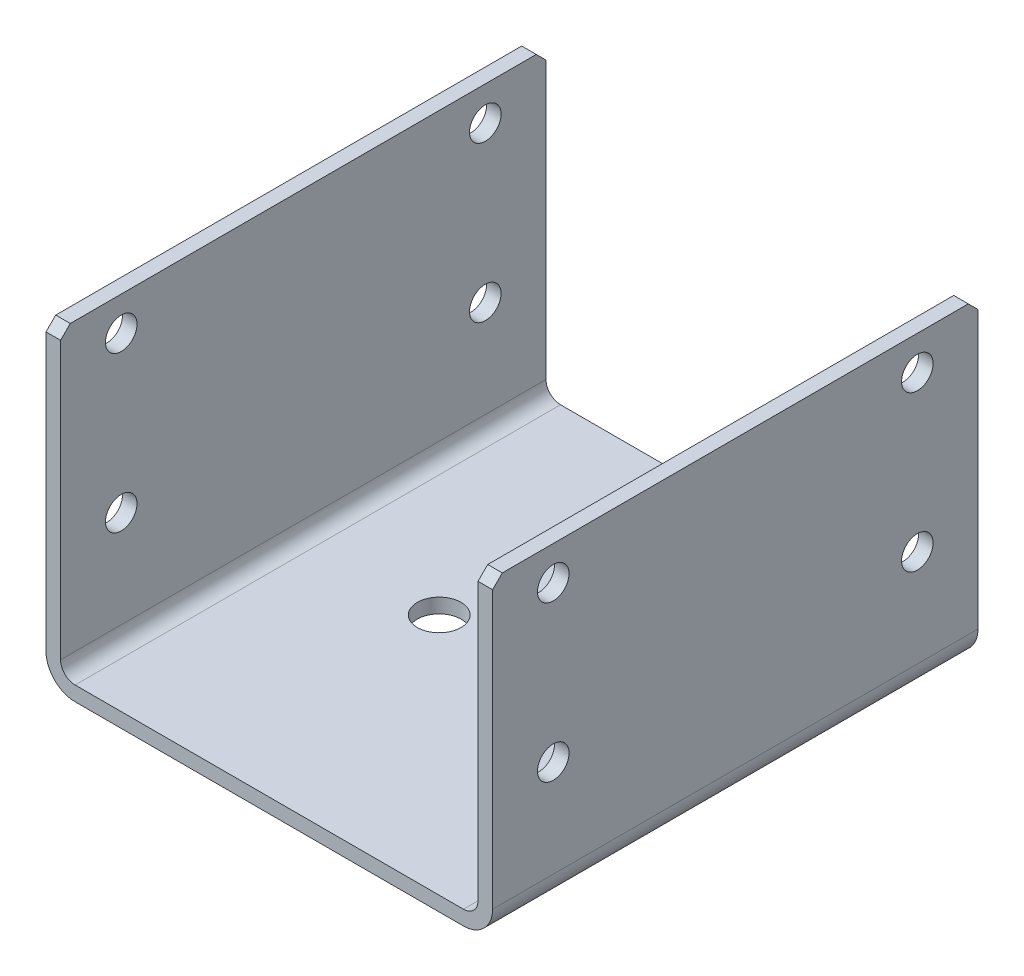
ISO-10303-21;
HEADER;
FILE_DESCRIPTION(('STEP AP214'),'2;1');
FILE_NAME('part.step','',(''),(''),'','','');
FILE_SCHEMA(('AUTOMOTIVE_DESIGN { 1 0 10303 214 1 1 1 1 }'));
ENDSEC;
DATA;
#1=APPLICATION_CONTEXT('core data for automotive mechanical design processes');
#2=APPLICATION_PROTOCOL_DEFINITION('international standard','automotive_design',2000,#1);
#3=PRODUCT_CONTEXT('',#1,'mechanical');
#4=PRODUCT('Part','Part','',(#3));
#5=PRODUCT_RELATED_PRODUCT_CATEGORY('part','',(#4));
#6=PRODUCT_DEFINITION_FORMATION('','',#4);
#7=PRODUCT_DEFINITION_CONTEXT('part definition',#1,'design');
#8=PRODUCT_DEFINITION('design','',#6,#7);
#9=PRODUCT_DEFINITION_SHAPE('','',#8);
#10=(LENGTH_UNIT() NAMED_UNIT(*) SI_UNIT(.MILLI.,.METRE.));
#11=(NAMED_UNIT(*) PLANE_ANGLE_UNIT() SI_UNIT($,.RADIAN.));
#12=(NAMED_UNIT(*) SI_UNIT($,.STERADIAN.) SOLID_ANGLE_UNIT());
#13=UNCERTAINTY_MEASURE_WITH_UNIT(LENGTH_MEASURE(1.E-05),#10,'distance_accuracy_value','');
#14=(GEOMETRIC_REPRESENTATION_CONTEXT(3) GLOBAL_UNCERTAINTY_ASSIGNED_CONTEXT((#13)) GLOBAL_UNIT_ASSIGNED_CONTEXT((#10,
#11,#12)) REPRESENTATION_CONTEXT('',''));
#15=CARTESIAN_POINT('',(0.,0.,0.));
#16=DIRECTION('',(0.,0.,1.));
#17=DIRECTION('',(1.,0.,0.));
#18=AXIS2_PLACEMENT_3D('',#15,#16,#17);
#19=CARTESIAN_POINT('',(-40.,6.,50.));
#20=DIRECTION('',(0.,0.,-1.));
#21=DIRECTION('',(-1.,0.,0.));
#22=AXIS2_PLACEMENT_3D('',#19,#20,#21);
#23=CYLINDRICAL_SURFACE('',#22,6.);
#24=DIRECTION('',(0.,0.,-1.));
#25=VECTOR('',#24,1.);
#26=CARTESIAN_POINT('',(-46.,6.,50.));
#27=LINE('',#26,#25);
#28=CARTESIAN_POINT('',(-46.,6.,50.));
#29=VERTEX_POINT('',#28);
#30=CARTESIAN_POINT('',(-46.,6.,-50.));
#31=VERTEX_POINT('',#30);
#32=EDGE_CURVE('E225',#29,#31,#27,.T.);
#33=ORIENTED_EDGE('',*,*,#32,.T.);
#34=CARTESIAN_POINT('',(-40.,6.,-50.));
#35=DIRECTION('',(0.,0.,1.));
#36=DIRECTION('',(1.,0.,0.));
#37=AXIS2_PLACEMENT_3D('',#34,#35,#36);
#38=CIRCLE('',#37,6.);
#39=CARTESIAN_POINT('',(-40.,0.,-50.));
#40=VERTEX_POINT('',#39);
#41=EDGE_CURVE('E182',#31,#40,#38,.T.);
#42=ORIENTED_EDGE('',*,*,#41,.T.);
#43=DIRECTION('',(0.,0.,-1.));
#44=VECTOR('',#43,1.);
#45=CARTESIAN_POINT('',(-40.,0.,50.));
#46=LINE('',#45,#44);
#47=CARTESIAN_POINT('',(-40.,0.,50.));
#48=VERTEX_POINT('',#47);
#49=EDGE_CURVE('E251',#48,#40,#46,.T.);
#50=ORIENTED_EDGE('',*,*,#49,.F.);
#51=CARTESIAN_POINT('',(-40.,6.,50.));
#52=DIRECTION('',(0.,0.,1.));
#53=DIRECTION('',(1.,0.,0.));
#54=AXIS2_PLACEMENT_3D('',#51,#52,#53);
#55=CIRCLE('',#54,6.);
#56=EDGE_CURVE('E208',#29,#48,#55,.T.);
#57=ORIENTED_EDGE('',*,*,#56,.F.);
#58=EDGE_LOOP('',(#33,#42,#50,#57));
#59=FACE_BOUND('',#58,.T.);
#60=ADVANCED_FACE('F16',(#59),#23,.T.);
#61=CARTESIAN_POINT('',(-40.,0.,50.));
#62=DIRECTION('',(0.,1.,0.));
#63=DIRECTION('',(0.,0.,1.));
#64=AXIS2_PLACEMENT_3D('',#61,#62,#63);
#65=PLANE('',#64);
#66=CARTESIAN_POINT('',(-15.,0.,0.));
#67=DIRECTION('',(0.,1.,0.));
#68=DIRECTION('',(0.,0.,1.));
#69=AXIS2_PLACEMENT_3D('',#66,#67,#68);
#70=CIRCLE('',#69,4.5);
#71=CARTESIAN_POINT('',(-15.,0.,4.5));
#72=VERTEX_POINT('',#71);
#73=EDGE_CURVE('E426',#72,#72,#70,.T.);
#74=ORIENTED_EDGE('',*,*,#73,.T.);
#75=EDGE_LOOP('',(#74));
#76=FACE_BOUND('',#75,.T.);
#77=CARTESIAN_POINT('',(15.,0.,0.));
#78=DIRECTION('',(0.,1.,0.));
#79=DIRECTION('',(0.,0.,1.));
#80=AXIS2_PLACEMENT_3D('',#77,#78,#79);
#81=CIRCLE('',#80,4.5);
#82=CARTESIAN_POINT('',(15.,0.,4.5));
#83=VERTEX_POINT('',#82);
#84=EDGE_CURVE('E431',#83,#83,#81,.T.);
#85=ORIENTED_EDGE('',*,*,#84,.T.);
#86=EDGE_LOOP('',(#85));
#87=FACE_BOUND('',#86,.T.);
#88=ORIENTED_EDGE('',*,*,#49,.T.);
#89=DIRECTION('',(1.,0.,0.));
#90=VECTOR('',#89,1.);
#91=CARTESIAN_POINT('',(-40.,0.,-50.));
#92=LINE('',#91,#90);
#93=CARTESIAN_POINT('',(40.,0.,-50.));
#94=VERTEX_POINT('',#93);
#95=EDGE_CURVE('E185',#40,#94,#92,.T.);
#96=ORIENTED_EDGE('',*,*,#95,.T.);
#97=DIRECTION('',(0.,0.,-1.));
#98=VECTOR('',#97,1.);
#99=CARTESIAN_POINT('',(40.,0.,50.));
#100=LINE('',#99,#98);
#101=CARTESIAN_POINT('',(40.,0.,50.));
#102=VERTEX_POINT('',#101);
#103=EDGE_CURVE('E249',#102,#94,#100,.T.);
#104=ORIENTED_EDGE('',*,*,#103,.F.);
#105=DIRECTION('',(1.,0.,0.));
#106=VECTOR('',#105,1.);
#107=CARTESIAN_POINT('',(-40.,0.,50.));
#108=LINE('',#107,#106);
#109=EDGE_CURVE('E211',#48,#102,#108,.T.);
#110=ORIENTED_EDGE('',*,*,#109,.F.);
#111=EDGE_LOOP('',(#88,#96,#104,#110));
#112=FACE_BOUND('',#111,.T.);
#113=ADVANCED_FACE('F274',(#76,#87,#112),#65,.F.);
#114=CARTESIAN_POINT('',(40.,6.,50.));
#115=DIRECTION('',(0.,0.,-1.));
#116=DIRECTION('',(-1.,0.,0.));
#117=AXIS2_PLACEMENT_3D('',#114,#115,#116);
#118=CYLINDRICAL_SURFACE('',#117,6.);
#119=ORIENTED_EDGE('',*,*,#103,.T.);
#120=CARTESIAN_POINT('',(40.,6.,-50.));
#121=DIRECTION('',(0.,0.,1.));
#122=DIRECTION('',(1.,0.,0.));
#123=AXIS2_PLACEMENT_3D('',#120,#121,#122);
#124=CIRCLE('',#123,6.);
#125=CARTESIAN_POINT('',(46.,6.,-50.));
#126=VERTEX_POINT('',#125);
#127=EDGE_CURVE('E188',#94,#126,#124,.T.);
#128=ORIENTED_EDGE('',*,*,#127,.T.);
#129=DIRECTION('',(0.,0.,-1.));
#130=VECTOR('',#129,1.);
#131=CARTESIAN_POINT('',(46.,6.,50.));
#132=LINE('',#131,#130);
#133=CARTESIAN_POINT('',(46.,6.,50.));
#134=VERTEX_POINT('',#133);
#135=EDGE_CURVE('E247',#134,#126,#132,.T.);
#136=ORIENTED_EDGE('',*,*,#135,.F.);
#137=CARTESIAN_POINT('',(40.,6.,50.));
#138=DIRECTION('',(0.,0.,1.));
#139=DIRECTION('',(1.,0.,0.));
#140=AXIS2_PLACEMENT_3D('',#137,#138,#139);
#141=CIRCLE('',#140,6.);
#142=EDGE_CURVE('E132',#102,#134,#141,.T.);
#143=ORIENTED_EDGE('',*,*,#142,.F.);
#144=EDGE_LOOP('',(#119,#128,#136,#143));
#145=FACE_BOUND('',#144,.T.);
#146=ADVANCED_FACE('F270',(#145),#118,.T.);
#147=CARTESIAN_POINT('',(46.,6.,50.));
#148=DIRECTION('',(-1.,0.,0.));
#149=DIRECTION('',(0.,0.,1.));
#150=AXIS2_PLACEMENT_3D('',#147,#148,#149);
#151=PLANE('',#150);
#152=CARTESIAN_POINT('',(46.,26.,-37.5));
#153=DIRECTION('',(-1.,0.,0.));
#154=DIRECTION('',(0.,0.,1.));
#155=AXIS2_PLACEMENT_3D('',#152,#153,#154);
#156=CIRCLE('',#155,3.25);
#157=CARTESIAN_POINT('',(46.,26.,-34.25));
#158=VERTEX_POINT('',#157);
#159=EDGE_CURVE('E404',#158,#158,#156,.T.);
#160=ORIENTED_EDGE('',*,*,#159,.T.);
#161=EDGE_LOOP('',(#160));
#162=FACE_BOUND('',#161,.T.);
#163=CARTESIAN_POINT('',(46.,26.,37.5));
#164=DIRECTION('',(-1.,0.,0.));
#165=DIRECTION('',(0.,0.,1.));
#166=AXIS2_PLACEMENT_3D('',#163,#164,#165);
#167=CIRCLE('',#166,3.25);
#168=CARTESIAN_POINT('',(46.,26.,40.75));
#169=VERTEX_POINT('',#168);
#170=EDGE_CURVE('E412',#169,#169,#167,.T.);
#171=ORIENTED_EDGE('',*,*,#170,.T.);
#172=EDGE_LOOP('',(#171));
#173=FACE_BOUND('',#172,.T.);
#174=CARTESIAN_POINT('',(46.,58.,37.5));
#175=DIRECTION('',(-1.,0.,0.));
#176=DIRECTION('',(0.,0.,1.));
#177=AXIS2_PLACEMENT_3D('',#174,#175,#176);
#178=CIRCLE('',#177,3.25);
#179=CARTESIAN_POINT('',(46.,58.,40.75));
#180=VERTEX_POINT('',#179);
#181=EDGE_CURVE('E437',#180,#180,#178,.T.);
#182=ORIENTED_EDGE('',*,*,#181,.T.);
#183=EDGE_LOOP('',(#182));
#184=FACE_BOUND('',#183,.T.);
#185=CARTESIAN_POINT('',(46.,58.,-37.5));
#186=DIRECTION('',(-1.,0.,0.));
#187=DIRECTION('',(0.,0.,1.));
#188=AXIS2_PLACEMENT_3D('',#185,#186,#187);
#189=CIRCLE('',#188,3.25);
#190=CARTESIAN_POINT('',(46.,58.,-34.25));
#191=VERTEX_POINT('',#190);
#192=EDGE_CURVE('E449',#191,#191,#189,.T.);
#193=ORIENTED_EDGE('',*,*,#192,.T.);
#194=EDGE_LOOP('',(#193));
#195=FACE_BOUND('',#194,.T.);
#196=DIRECTION('',(0.,1.,0.));
#197=VECTOR('',#196,1.);
#198=CARTESIAN_POINT('',(46.,6.,-50.));
#199=LINE('',#198,#197);
#200=CARTESIAN_POINT('',(46.,63.,-50.));
#201=VERTEX_POINT('',#200);
#202=EDGE_CURVE('E191',#126,#201,#199,.T.);
#203=ORIENTED_EDGE('',*,*,#202,.T.);
#204=DIRECTION('',(0.,-0.707106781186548,-0.707106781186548));
#205=VECTOR('',#204,1.);
#206=CARTESIAN_POINT('',(46.,65.,-48.));
#207=LINE('',#206,#205);
#208=CARTESIAN_POINT('',(46.,65.,-48.));
#209=VERTEX_POINT('',#208);
#210=EDGE_CURVE('E146',#209,#201,#207,.T.);
#211=ORIENTED_EDGE('',*,*,#210,.F.);
#212=DIRECTION('',(0.,0.,-1.));
#213=VECTOR('',#212,1.);
#214=CARTESIAN_POINT('',(46.,65.,50.));
#215=LINE('',#214,#213);
#216=CARTESIAN_POINT('',(46.,65.,48.));
#217=VERTEX_POINT('',#216);
#218=EDGE_CURVE('E145',#217,#209,#215,.T.);
#219=ORIENTED_EDGE('',*,*,#218,.F.);
#220=DIRECTION('',(0.,0.707106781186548,-0.707106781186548));
#221=VECTOR('',#220,1.);
#222=CARTESIAN_POINT('',(46.,63.,50.));
#223=LINE('',#222,#221);
#224=CARTESIAN_POINT('',(46.,63.,50.));
#225=VERTEX_POINT('',#224);
#226=EDGE_CURVE('E139',#225,#217,#223,.T.);
#227=ORIENTED_EDGE('',*,*,#226,.F.);
#228=DIRECTION('',(0.,1.,0.));
#229=VECTOR('',#228,1.);
#230=CARTESIAN_POINT('',(46.,6.,50.));
#231=LINE('',#230,#229);
#232=EDGE_CURVE('E128',#134,#225,#231,.T.);
#233=ORIENTED_EDGE('',*,*,#232,.F.);
#234=ORIENTED_EDGE('',*,*,#135,.T.);
#235=EDGE_LOOP('',(#203,#211,#219,#227,#233,#234));
#236=FACE_BOUND('',#235,.T.);
#237=ADVANCED_FACE('F142',(#162,#173,#184,#195,#236),#151,.F.);
#238=CARTESIAN_POINT('',(46.,65.,50.));
#239=DIRECTION('',(0.,-1.,0.));
#240=DIRECTION('',(0.,0.,-1.));
#241=AXIS2_PLACEMENT_3D('',#238,#239,#240);
#242=PLANE('',#241);
#243=ORIENTED_EDGE('',*,*,#218,.T.);
#244=DIRECTION('',(1.,0.,0.));
#245=VECTOR('',#244,1.);
#246=CARTESIAN_POINT('',(-46.,65.,-48.));
#247=LINE('',#246,#245);
#248=CARTESIAN_POINT('',(43.,65.,-48.));
#249=VERTEX_POINT('',#248);
#250=EDGE_CURVE('E167',#249,#209,#247,.T.);
#251=ORIENTED_EDGE('',*,*,#250,.F.);
#252=DIRECTION('',(0.,0.,-1.));
#253=VECTOR('',#252,1.);
#254=CARTESIAN_POINT('',(43.,65.,50.));
#255=LINE('',#254,#253);
#256=CARTESIAN_POINT('',(43.,65.,48.));
#257=VERTEX_POINT('',#256);
#258=EDGE_CURVE('E243',#257,#249,#255,.T.);
#259=ORIENTED_EDGE('',*,*,#258,.F.);
#260=DIRECTION('',(1.,0.,0.));
#261=VECTOR('',#260,1.);
#262=CARTESIAN_POINT('',(-46.,65.,48.));
#263=LINE('',#262,#261);
#264=EDGE_CURVE('E171',#257,#217,#263,.T.);
#265=ORIENTED_EDGE('',*,*,#264,.T.);
#266=EDGE_LOOP('',(#243,#251,#259,#265));
#267=FACE_BOUND('',#266,.T.);
#268=ADVANCED_FACE('F268',(#267),#242,.F.);
#269=CARTESIAN_POINT('',(43.,65.,50.));
#270=DIRECTION('',(1.,0.,0.));
#271=DIRECTION('',(0.,0.,-1.));
#272=AXIS2_PLACEMENT_3D('',#269,#270,#271);
#273=PLANE('',#272);
#274=CARTESIAN_POINT('',(43.,26.,-37.5));
#275=DIRECTION('',(1.,0.,0.));
#276=DIRECTION('',(0.,0.,-1.));
#277=AXIS2_PLACEMENT_3D('',#274,#275,#276);
#278=CIRCLE('',#277,3.25);
#279=CARTESIAN_POINT('',(43.,26.,-40.75));
#280=VERTEX_POINT('',#279);
#281=EDGE_CURVE('E407',#280,#280,#278,.T.);
#282=ORIENTED_EDGE('',*,*,#281,.T.);
#283=EDGE_LOOP('',(#282));
#284=FACE_BOUND('',#283,.T.);
#285=CARTESIAN_POINT('',(43.,26.,37.5));
#286=DIRECTION('',(1.,0.,0.));
#287=DIRECTION('',(0.,0.,-1.));
#288=AXIS2_PLACEMENT_3D('',#285,#286,#287);
#289=CIRCLE('',#288,3.25);
#290=CARTESIAN_POINT('',(43.,26.,34.25));
#291=VERTEX_POINT('',#290);
#292=EDGE_CURVE('E423',#291,#291,#289,.T.);
#293=ORIENTED_EDGE('',*,*,#292,.T.);
#294=EDGE_LOOP('',(#293));
#295=FACE_BOUND('',#294,.T.);
#296=CARTESIAN_POINT('',(43.,58.,37.5));
#297=DIRECTION('',(1.,0.,0.));
#298=DIRECTION('',(0.,0.,-1.));
#299=AXIS2_PLACEMENT_3D('',#296,#297,#298);
#300=CIRCLE('',#299,3.25);
#301=CARTESIAN_POINT('',(43.,58.,34.25));
#302=VERTEX_POINT('',#301);
#303=EDGE_CURVE('E446',#302,#302,#300,.F.);
#304=ORIENTED_EDGE('',*,*,#303,.F.);
#305=EDGE_LOOP('',(#304));
#306=FACE_BOUND('',#305,.T.);
#307=CARTESIAN_POINT('',(43.,58.,-37.5));
#308=DIRECTION('',(1.,0.,0.));
#309=DIRECTION('',(0.,0.,-1.));
#310=AXIS2_PLACEMENT_3D('',#307,#308,#309);
#311=CIRCLE('',#310,3.25);
#312=CARTESIAN_POINT('',(43.,58.,-40.75));
#313=VERTEX_POINT('',#312);
#314=EDGE_CURVE('E147',#313,#313,#311,.F.);
#315=ORIENTED_EDGE('',*,*,#314,.F.);
#316=EDGE_LOOP('',(#315));
#317=FACE_BOUND('',#316,.T.);
#318=ORIENTED_EDGE('',*,*,#258,.T.);
#319=DIRECTION('',(0.,-0.707106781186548,-0.707106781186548));
#320=VECTOR('',#319,1.);
#321=CARTESIAN_POINT('',(43.,114.,1.));
#322=LINE('',#321,#320);
#323=CARTESIAN_POINT('',(43.,63.,-50.));
#324=VERTEX_POINT('',#323);
#325=EDGE_CURVE('E175',#249,#324,#322,.T.);
#326=ORIENTED_EDGE('',*,*,#325,.T.);
#327=DIRECTION('',(0.,-1.,0.));
#328=VECTOR('',#327,1.);
#329=CARTESIAN_POINT('',(43.,65.,-50.));
#330=LINE('',#329,#328);
#331=CARTESIAN_POINT('',(43.,6.,-50.));
#332=VERTEX_POINT('',#331);
#333=EDGE_CURVE('E193',#324,#332,#330,.T.);
#334=ORIENTED_EDGE('',*,*,#333,.T.);
#335=DIRECTION('',(0.,0.,-1.));
#336=VECTOR('',#335,1.);
#337=CARTESIAN_POINT('',(43.,6.,50.));
#338=LINE('',#337,#336);
#339=CARTESIAN_POINT('',(43.,6.,50.));
#340=VERTEX_POINT('',#339);
#341=EDGE_CURVE('E240',#340,#332,#338,.T.);
#342=ORIENTED_EDGE('',*,*,#341,.F.);
#343=DIRECTION('',(0.,-1.,0.));
#344=VECTOR('',#343,1.);
#345=CARTESIAN_POINT('',(43.,65.,50.));
#346=LINE('',#345,#344);
#347=CARTESIAN_POINT('',(43.,63.,50.));
#348=VERTEX_POINT('',#347);
#349=EDGE_CURVE('E136',#348,#340,#346,.T.);
#350=ORIENTED_EDGE('',*,*,#349,.F.);
#351=DIRECTION('',(0.,0.707106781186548,-0.707106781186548));
#352=VECTOR('',#351,1.);
#353=CARTESIAN_POINT('',(43.,64.,49.));
#354=LINE('',#353,#352);
#355=EDGE_CURVE('E37',#348,#257,#354,.T.);
#356=ORIENTED_EDGE('',*,*,#355,.T.);
#357=EDGE_LOOP('',(#318,#326,#334,#342,#350,#356));
#358=FACE_BOUND('',#357,.T.);
#359=ADVANCED_FACE('F264',(#284,#295,#306,#317,#358),#273,.F.);
#360=CARTESIAN_POINT('',(40.,6.,50.));
#361=DIRECTION('',(0.,0.,-1.));
#362=DIRECTION('',(-1.,0.,0.));
#363=AXIS2_PLACEMENT_3D('',#360,#361,#362);
#364=CYLINDRICAL_SURFACE('',#363,3.);
#365=ORIENTED_EDGE('',*,*,#341,.T.);
#366=CARTESIAN_POINT('',(40.,6.,-50.));
#367=DIRECTION('',(0.,0.,-1.));
#368=DIRECTION('',(-1.,0.,0.));
#369=AXIS2_PLACEMENT_3D('',#366,#367,#368);
#370=CIRCLE('',#369,3.);
#371=CARTESIAN_POINT('',(40.,3.,-50.));
#372=VERTEX_POINT('',#371);
#373=EDGE_CURVE('E195',#332,#372,#370,.T.);
#374=ORIENTED_EDGE('',*,*,#373,.T.);
#375=DIRECTION('',(0.,0.,-1.));
#376=VECTOR('',#375,1.);
#377=CARTESIAN_POINT('',(40.,3.,50.));
#378=LINE('',#377,#376);
#379=CARTESIAN_POINT('',(40.,3.,50.));
#380=VERTEX_POINT('',#379);
#381=EDGE_CURVE('E238',#380,#372,#378,.T.);
#382=ORIENTED_EDGE('',*,*,#381,.F.);
#383=CARTESIAN_POINT('',(40.,6.,50.));
#384=DIRECTION('',(0.,0.,-1.));
#385=DIRECTION('',(-1.,0.,0.));
#386=AXIS2_PLACEMENT_3D('',#383,#384,#385);
#387=CIRCLE('',#386,3.);
#388=EDGE_CURVE('E215',#340,#380,#387,.T.);
#389=ORIENTED_EDGE('',*,*,#388,.F.);
#390=EDGE_LOOP('',(#365,#374,#382,#389));
#391=FACE_BOUND('',#390,.T.);
#392=ADVANCED_FACE('F307',(#391),#364,.F.);
#393=CARTESIAN_POINT('',(40.,3.,50.));
#394=DIRECTION('',(0.,-1.,0.));
#395=DIRECTION('',(0.,0.,-1.));
#396=AXIS2_PLACEMENT_3D('',#393,#394,#395);
#397=PLANE('',#396);
#398=CARTESIAN_POINT('',(-15.,3.,0.));
#399=DIRECTION('',(0.,1.,0.));
#400=DIRECTION('',(0.,0.,1.));
#401=AXIS2_PLACEMENT_3D('',#398,#399,#400);
#402=CIRCLE('',#401,4.5);
#403=CARTESIAN_POINT('',(-15.,3.,4.5));
#404=VERTEX_POINT('',#403);
#405=EDGE_CURVE('E428',#404,#404,#402,.T.);
#406=ORIENTED_EDGE('',*,*,#405,.F.);
#407=EDGE_LOOP('',(#406));
#408=FACE_BOUND('',#407,.T.);
#409=CARTESIAN_POINT('',(15.,3.,0.));
#410=DIRECTION('',(0.,1.,0.));
#411=DIRECTION('',(0.,0.,1.));
#412=AXIS2_PLACEMENT_3D('',#409,#410,#411);
#413=CIRCLE('',#412,4.5);
#414=CARTESIAN_POINT('',(15.,3.,4.5));
#415=VERTEX_POINT('',#414);
#416=EDGE_CURVE('E434',#415,#415,#413,.T.);
#417=ORIENTED_EDGE('',*,*,#416,.F.);
#418=EDGE_LOOP('',(#417));
#419=FACE_BOUND('',#418,.T.);
#420=ORIENTED_EDGE('',*,*,#381,.T.);
#421=DIRECTION('',(-1.,0.,0.));
#422=VECTOR('',#421,1.);
#423=CARTESIAN_POINT('',(40.,3.,-50.));
#424=LINE('',#423,#422);
#425=CARTESIAN_POINT('',(-40.,3.,-50.));
#426=VERTEX_POINT('',#425);
#427=EDGE_CURVE('E198',#372,#426,#424,.T.);
#428=ORIENTED_EDGE('',*,*,#427,.T.);
#429=DIRECTION('',(0.,0.,-1.));
#430=VECTOR('',#429,1.);
#431=CARTESIAN_POINT('',(-40.,3.,50.));
#432=LINE('',#431,#430);
#433=CARTESIAN_POINT('',(-40.,3.,50.));
#434=VERTEX_POINT('',#433);
#435=EDGE_CURVE('E236',#434,#426,#432,.T.);
#436=ORIENTED_EDGE('',*,*,#435,.F.);
#437=DIRECTION('',(-1.,0.,0.));
#438=VECTOR('',#437,1.);
#439=CARTESIAN_POINT('',(40.,3.,50.));
#440=LINE('',#439,#438);
#441=EDGE_CURVE('E217',#380,#434,#440,.T.);
#442=ORIENTED_EDGE('',*,*,#441,.F.);
#443=EDGE_LOOP('',(#420,#428,#436,#442));
#444=FACE_BOUND('',#443,.T.);
#445=ADVANCED_FACE('F304',(#408,#419,#444),#397,.F.);
#446=CARTESIAN_POINT('',(-40.,6.,50.));
#447=DIRECTION('',(0.,0.,-1.));
#448=DIRECTION('',(-1.,0.,0.));
#449=AXIS2_PLACEMENT_3D('',#446,#447,#448);
#450=CYLINDRICAL_SURFACE('',#449,3.);
#451=ORIENTED_EDGE('',*,*,#435,.T.);
#452=CARTESIAN_POINT('',(-40.,6.,-50.));
#453=DIRECTION('',(0.,0.,-1.));
#454=DIRECTION('',(-1.,0.,0.));
#455=AXIS2_PLACEMENT_3D('',#452,#453,#454);
#456=CIRCLE('',#455,3.);
#457=CARTESIAN_POINT('',(-43.,6.,-50.));
#458=VERTEX_POINT('',#457);
#459=EDGE_CURVE('E201',#426,#458,#456,.T.);
#460=ORIENTED_EDGE('',*,*,#459,.T.);
#461=DIRECTION('',(0.,0.,-1.));
#462=VECTOR('',#461,1.);
#463=CARTESIAN_POINT('',(-43.,6.,50.));
#464=LINE('',#463,#462);
#465=CARTESIAN_POINT('',(-43.,6.,50.));
#466=VERTEX_POINT('',#465);
#467=EDGE_CURVE('E234',#466,#458,#464,.T.);
#468=ORIENTED_EDGE('',*,*,#467,.F.);
#469=CARTESIAN_POINT('',(-40.,6.,50.));
#470=DIRECTION('',(0.,0.,-1.));
#471=DIRECTION('',(-1.,0.,0.));
#472=AXIS2_PLACEMENT_3D('',#469,#470,#471);
#473=CIRCLE('',#472,3.);
#474=EDGE_CURVE('E219',#434,#466,#473,.T.);
#475=ORIENTED_EDGE('',*,*,#474,.F.);
#476=EDGE_LOOP('',(#451,#460,#468,#475));
#477=FACE_BOUND('',#476,.T.);
#478=ADVANCED_FACE('F299',(#477),#450,.F.);
#479=CARTESIAN_POINT('',(-43.,6.,50.));
#480=DIRECTION('',(-1.,0.,0.));
#481=DIRECTION('',(0.,0.,1.));
#482=AXIS2_PLACEMENT_3D('',#479,#480,#481);
#483=PLANE('',#482);
#484=CARTESIAN_POINT('',(-43.,26.,-37.5));
#485=DIRECTION('',(-1.,0.,0.));
#486=DIRECTION('',(0.,0.,1.));
#487=AXIS2_PLACEMENT_3D('',#484,#485,#486);
#488=CIRCLE('',#487,3.25);
#489=CARTESIAN_POINT('',(-43.,26.,-34.25));
#490=VERTEX_POINT('',#489);
#491=EDGE_CURVE('E409',#490,#490,#488,.T.);
#492=ORIENTED_EDGE('',*,*,#491,.T.);
#493=EDGE_LOOP('',(#492));
#494=FACE_BOUND('',#493,.T.);
#495=CARTESIAN_POINT('',(-43.,26.,37.5));
#496=DIRECTION('',(-1.,0.,0.));
#497=DIRECTION('',(0.,0.,1.));
#498=AXIS2_PLACEMENT_3D('',#495,#496,#497);
#499=CIRCLE('',#498,3.25);
#500=CARTESIAN_POINT('',(-43.,26.,40.75));
#501=VERTEX_POINT('',#500);
#502=EDGE_CURVE('E419',#501,#501,#499,.T.);
#503=ORIENTED_EDGE('',*,*,#502,.T.);
#504=EDGE_LOOP('',(#503));
#505=FACE_BOUND('',#504,.T.);
#506=CARTESIAN_POINT('',(-43.,58.,37.5));
#507=DIRECTION('',(-1.,0.,0.));
#508=DIRECTION('',(0.,0.,1.));
#509=AXIS2_PLACEMENT_3D('',#506,#507,#508);
#510=CIRCLE('',#509,3.25);
#511=CARTESIAN_POINT('',(-43.,58.,40.75));
#512=VERTEX_POINT('',#511);
#513=EDGE_CURVE('E443',#512,#512,#510,.F.);
#514=ORIENTED_EDGE('',*,*,#513,.F.);
#515=EDGE_LOOP('',(#514));
#516=FACE_BOUND('',#515,.T.);
#517=CARTESIAN_POINT('',(-43.,58.,-37.5));
#518=DIRECTION('',(-1.,0.,0.));
#519=DIRECTION('',(0.,0.,1.));
#520=AXIS2_PLACEMENT_3D('',#517,#518,#519);
#521=CIRCLE('',#520,3.25);
#522=CARTESIAN_POINT('',(-43.,58.,-34.25));
#523=VERTEX_POINT('',#522);
#524=EDGE_CURVE('E152',#523,#523,#521,.F.);
#525=ORIENTED_EDGE('',*,*,#524,.F.);
#526=EDGE_LOOP('',(#525));
#527=FACE_BOUND('',#526,.T.);
#528=DIRECTION('',(0.,1.,0.));
#529=VECTOR('',#528,1.);
#530=CARTESIAN_POINT('',(-43.,6.,-50.));
#531=LINE('',#530,#529);
#532=CARTESIAN_POINT('',(-43.,63.,-50.));
#533=VERTEX_POINT('',#532);
#534=EDGE_CURVE('E204',#458,#533,#531,.T.);
#535=ORIENTED_EDGE('',*,*,#534,.T.);
#536=DIRECTION('',(0.,0.707106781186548,0.707106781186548));
#537=VECTOR('',#536,1.);
#538=CARTESIAN_POINT('',(-43.,84.5,-28.5));
#539=LINE('',#538,#537);
#540=CARTESIAN_POINT('',(-43.,65.,-48.));
#541=VERTEX_POINT('',#540);
#542=EDGE_CURVE('E164',#533,#541,#539,.T.);
#543=ORIENTED_EDGE('',*,*,#542,.T.);
#544=DIRECTION('',(0.,0.,-1.));
#545=VECTOR('',#544,1.);
#546=CARTESIAN_POINT('',(-43.,65.,50.));
#547=LINE('',#546,#545);
#548=CARTESIAN_POINT('',(-43.,65.,48.));
#549=VERTEX_POINT('',#548);
#550=EDGE_CURVE('E231',#549,#541,#547,.T.);
#551=ORIENTED_EDGE('',*,*,#550,.F.);
#552=DIRECTION('',(0.,-0.707106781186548,0.707106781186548));
#553=VECTOR('',#552,1.);
#554=CARTESIAN_POINT('',(-43.,34.5,78.5));
#555=LINE('',#554,#553);
#556=CARTESIAN_POINT('',(-43.,63.,50.));
#557=VERTEX_POINT('',#556);
#558=EDGE_CURVE('E178',#549,#557,#555,.T.);
#559=ORIENTED_EDGE('',*,*,#558,.T.);
#560=DIRECTION('',(0.,1.,0.));
#561=VECTOR('',#560,1.);
#562=CARTESIAN_POINT('',(-43.,6.,50.));
#563=LINE('',#562,#561);
#564=EDGE_CURVE('E221',#466,#557,#563,.T.);
#565=ORIENTED_EDGE('',*,*,#564,.F.);
#566=ORIENTED_EDGE('',*,*,#467,.T.);
#567=EDGE_LOOP('',(#535,#543,#551,#559,#565,#566));
#568=FACE_BOUND('',#567,.T.);
#569=ADVANCED_FACE('F293',(#494,#505,#516,#527,#568),#483,.F.);
#570=CARTESIAN_POINT('',(-43.,65.,50.));
#571=DIRECTION('',(0.,-1.,0.));
#572=DIRECTION('',(0.,0.,-1.));
#573=AXIS2_PLACEMENT_3D('',#570,#571,#572);
#574=PLANE('',#573);
#575=ORIENTED_EDGE('',*,*,#550,.T.);
#576=CARTESIAN_POINT('',(-46.,65.,-48.));
#577=VERTEX_POINT('',#576);
#578=EDGE_CURVE('E165',#577,#541,#247,.T.);
#579=ORIENTED_EDGE('',*,*,#578,.F.);
#580=DIRECTION('',(0.,0.,-1.));
#581=VECTOR('',#580,1.);
#582=CARTESIAN_POINT('',(-46.,65.,50.));
#583=LINE('',#582,#581);
#584=CARTESIAN_POINT('',(-46.,65.,48.));
#585=VERTEX_POINT('',#584);
#586=EDGE_CURVE('E228',#585,#577,#583,.T.);
#587=ORIENTED_EDGE('',*,*,#586,.F.);
#588=EDGE_CURVE('E168',#585,#549,#263,.T.);
#589=ORIENTED_EDGE('',*,*,#588,.T.);
#590=EDGE_LOOP('',(#575,#579,#587,#589));
#591=FACE_BOUND('',#590,.T.);
#592=ADVANCED_FACE('F290',(#591),#574,.F.);
#593=CARTESIAN_POINT('',(-46.,65.,50.));
#594=DIRECTION('',(1.,0.,0.));
#595=DIRECTION('',(0.,0.,-1.));
#596=AXIS2_PLACEMENT_3D('',#593,#594,#595);
#597=PLANE('',#596);
#598=CARTESIAN_POINT('',(-46.,26.,-37.5));
#599=DIRECTION('',(-1.,0.,0.));
#600=DIRECTION('',(0.,0.,1.));
#601=AXIS2_PLACEMENT_3D('',#598,#599,#600);
#602=CIRCLE('',#601,3.25);
#603=CARTESIAN_POINT('',(-46.,26.,-34.25));
#604=VERTEX_POINT('',#603);
#605=EDGE_CURVE('E735',#604,#604,#602,.T.);
#606=ORIENTED_EDGE('',*,*,#605,.F.);
#607=EDGE_LOOP('',(#606));
#608=FACE_BOUND('',#607,.T.);
#609=CARTESIAN_POINT('',(-46.,26.,37.5));
#610=DIRECTION('',(-1.,0.,0.));
#611=DIRECTION('',(0.,0.,1.));
#612=AXIS2_PLACEMENT_3D('',#609,#610,#611);
#613=CIRCLE('',#612,3.25);
#614=CARTESIAN_POINT('',(-46.,26.,40.75));
#615=VERTEX_POINT('',#614);
#616=EDGE_CURVE('E408',#615,#615,#613,.T.);
#617=ORIENTED_EDGE('',*,*,#616,.F.);
#618=EDGE_LOOP('',(#617));
#619=FACE_BOUND('',#618,.T.);
#620=CARTESIAN_POINT('',(-46.,58.,37.5));
#621=DIRECTION('',(-1.,0.,0.));
#622=DIRECTION('',(0.,0.,1.));
#623=AXIS2_PLACEMENT_3D('',#620,#621,#622);
#624=CIRCLE('',#623,3.25);
#625=CARTESIAN_POINT('',(-46.,58.,40.75));
#626=VERTEX_POINT('',#625);
#627=EDGE_CURVE('E440',#626,#626,#624,.T.);
#628=ORIENTED_EDGE('',*,*,#627,.F.);
#629=EDGE_LOOP('',(#628));
#630=FACE_BOUND('',#629,.T.);
#631=CARTESIAN_POINT('',(-46.,58.,-37.5));
#632=DIRECTION('',(-1.,0.,0.));
#633=DIRECTION('',(0.,0.,1.));
#634=AXIS2_PLACEMENT_3D('',#631,#632,#633);
#635=CIRCLE('',#634,3.25);
#636=CARTESIAN_POINT('',(-46.,58.,-34.25));
#637=VERTEX_POINT('',#636);
#638=EDGE_CURVE('E452',#637,#637,#635,.T.);
#639=ORIENTED_EDGE('',*,*,#638,.F.);
#640=EDGE_LOOP('',(#639));
#641=FACE_BOUND('',#640,.T.);
#642=ORIENTED_EDGE('',*,*,#586,.T.);
#643=DIRECTION('',(0.,-0.707106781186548,-0.707106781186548));
#644=VECTOR('',#643,1.);
#645=CARTESIAN_POINT('',(-46.,65.,-48.));
#646=LINE('',#645,#644);
#647=CARTESIAN_POINT('',(-46.,63.,-50.));
#648=VERTEX_POINT('',#647);
#649=EDGE_CURVE('E157',#577,#648,#646,.T.);
#650=ORIENTED_EDGE('',*,*,#649,.T.);
#651=DIRECTION('',(0.,-1.,0.));
#652=VECTOR('',#651,1.);
#653=CARTESIAN_POINT('',(-46.,65.,-50.));
#654=LINE('',#653,#652);
#655=EDGE_CURVE('E206',#648,#31,#654,.T.);
#656=ORIENTED_EDGE('',*,*,#655,.T.);
#657=ORIENTED_EDGE('',*,*,#32,.F.);
#658=DIRECTION('',(0.,-1.,0.));
#659=VECTOR('',#658,1.);
#660=CARTESIAN_POINT('',(-46.,65.,50.));
#661=LINE('',#660,#659);
#662=CARTESIAN_POINT('',(-46.,63.,50.));
#663=VERTEX_POINT('',#662);
#664=EDGE_CURVE('E223',#663,#29,#661,.T.);
#665=ORIENTED_EDGE('',*,*,#664,.F.);
#666=DIRECTION('',(0.,0.707106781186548,-0.707106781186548));
#667=VECTOR('',#666,1.);
#668=CARTESIAN_POINT('',(-46.,63.,50.));
#669=LINE('',#668,#667);
#670=EDGE_CURVE('E30',#663,#585,#669,.T.);
#671=ORIENTED_EDGE('',*,*,#670,.T.);
#672=EDGE_LOOP('',(#642,#650,#656,#657,#665,#671));
#673=FACE_BOUND('',#672,.T.);
#674=ADVANCED_FACE('F282',(#608,#619,#630,#641,#673),#597,.F.);
#675=CARTESIAN_POINT('',(-40.,6.,50.));
#676=DIRECTION('',(0.,0.,1.));
#677=DIRECTION('',(1.,0.,0.));
#678=AXIS2_PLACEMENT_3D('',#675,#676,#677);
#679=PLANE('',#678);
#680=ORIENTED_EDGE('',*,*,#564,.T.);
#681=DIRECTION('',(1.,0.,0.));
#682=VECTOR('',#681,1.);
#683=CARTESIAN_POINT('',(-46.,63.,50.));
#684=LINE('',#683,#682);
#685=EDGE_CURVE('E160',#663,#557,#684,.T.);
#686=ORIENTED_EDGE('',*,*,#685,.F.);
#687=ORIENTED_EDGE('',*,*,#664,.T.);
#688=ORIENTED_EDGE('',*,*,#56,.T.);
#689=ORIENTED_EDGE('',*,*,#109,.T.);
#690=ORIENTED_EDGE('',*,*,#142,.T.);
#691=ORIENTED_EDGE('',*,*,#232,.T.);
#692=DIRECTION('',(1.,0.,0.));
#693=VECTOR('',#692,1.);
#694=CARTESIAN_POINT('',(-40.,63.,50.));
#695=LINE('',#694,#693);
#696=EDGE_CURVE('E11',#348,#225,#695,.T.);
#697=ORIENTED_EDGE('',*,*,#696,.F.);
#698=ORIENTED_EDGE('',*,*,#349,.T.);
#699=ORIENTED_EDGE('',*,*,#388,.T.);
#700=ORIENTED_EDGE('',*,*,#441,.T.);
#701=ORIENTED_EDGE('',*,*,#474,.T.);
#702=EDGE_LOOP('',(#680,#686,#687,#688,#689,#690,#691,#697,#698,#699,#700,#701));
#703=FACE_BOUND('',#702,.T.);
#704=ADVANCED_FACE('F129',(#703),#679,.T.);
#705=CARTESIAN_POINT('',(-40.,6.,-50.));
#706=DIRECTION('',(0.,0.,1.));
#707=DIRECTION('',(1.,0.,0.));
#708=AXIS2_PLACEMENT_3D('',#705,#706,#707);
#709=PLANE('',#708);
#710=ORIENTED_EDGE('',*,*,#41,.F.);
#711=ORIENTED_EDGE('',*,*,#655,.F.);
#712=DIRECTION('',(1.,0.,0.));
#713=VECTOR('',#712,1.);
#714=CARTESIAN_POINT('',(-46.,63.,-50.));
#715=LINE('',#714,#713);
#716=EDGE_CURVE('E161',#648,#533,#715,.T.);
#717=ORIENTED_EDGE('',*,*,#716,.T.);
#718=ORIENTED_EDGE('',*,*,#534,.F.);
#719=ORIENTED_EDGE('',*,*,#459,.F.);
#720=ORIENTED_EDGE('',*,*,#427,.F.);
#721=ORIENTED_EDGE('',*,*,#373,.F.);
#722=ORIENTED_EDGE('',*,*,#333,.F.);
#723=DIRECTION('',(1.,0.,0.));
#724=VECTOR('',#723,1.);
#725=CARTESIAN_POINT('',(-40.,63.,-50.));
#726=LINE('',#725,#724);
#727=EDGE_CURVE('E23',#324,#201,#726,.T.);
#728=ORIENTED_EDGE('',*,*,#727,.T.);
#729=ORIENTED_EDGE('',*,*,#202,.F.);
#730=ORIENTED_EDGE('',*,*,#127,.F.);
#731=ORIENTED_EDGE('',*,*,#95,.F.);
#732=EDGE_LOOP('',(#710,#711,#717,#718,#719,#720,#721,#722,#728,#729,#730,#731));
#733=FACE_BOUND('',#732,.T.);
#734=ADVANCED_FACE('F257',(#733),#709,.F.);
#735=CARTESIAN_POINT('',(-46.,65.,-48.));
#736=DIRECTION('',(0.,-0.707106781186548,0.707106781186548));
#737=DIRECTION('',(0.,-0.707106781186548,-0.707106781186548));
#738=AXIS2_PLACEMENT_3D('',#735,#736,#737);
#739=PLANE('',#738);
#740=ORIENTED_EDGE('',*,*,#250,.T.);
#741=ORIENTED_EDGE('',*,*,#210,.T.);
#742=ORIENTED_EDGE('',*,*,#727,.F.);
#743=ORIENTED_EDGE('',*,*,#325,.F.);
#744=EDGE_LOOP('',(#740,#741,#742,#743));
#745=FACE_BOUND('',#744,.T.);
#746=ADVANCED_FACE('F261',(#745),#739,.F.);
#747=ORIENTED_EDGE('',*,*,#716,.F.);
#748=ORIENTED_EDGE('',*,*,#649,.F.);
#749=ORIENTED_EDGE('',*,*,#578,.T.);
#750=ORIENTED_EDGE('',*,*,#542,.F.);
#751=EDGE_LOOP('',(#747,#748,#749,#750));
#752=FACE_BOUND('',#751,.T.);
#753=ADVANCED_FACE('F287',(#752),#739,.F.);
#754=CARTESIAN_POINT('',(-46.,63.,50.));
#755=DIRECTION('',(0.,-0.707106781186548,-0.707106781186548));
#756=DIRECTION('',(0.,0.707106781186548,-0.707106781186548));
#757=AXIS2_PLACEMENT_3D('',#754,#755,#756);
#758=PLANE('',#757);
#759=ORIENTED_EDGE('',*,*,#696,.T.);
#760=ORIENTED_EDGE('',*,*,#226,.T.);
#761=ORIENTED_EDGE('',*,*,#264,.F.);
#762=ORIENTED_EDGE('',*,*,#355,.F.);
#763=EDGE_LOOP('',(#759,#760,#761,#762));
#764=FACE_BOUND('',#763,.T.);
#765=ADVANCED_FACE('F138',(#764),#758,.F.);
#766=ORIENTED_EDGE('',*,*,#588,.F.);
#767=ORIENTED_EDGE('',*,*,#670,.F.);
#768=ORIENTED_EDGE('',*,*,#685,.T.);
#769=ORIENTED_EDGE('',*,*,#558,.F.);
#770=EDGE_LOOP('',(#766,#767,#768,#769));
#771=FACE_BOUND('',#770,.T.);
#772=ADVANCED_FACE('F309',(#771),#758,.F.);
#773=CARTESIAN_POINT('',(46.,58.,-37.5));
#774=DIRECTION('',(-1.,0.,0.));
#775=DIRECTION('',(0.,0.,1.));
#776=AXIS2_PLACEMENT_3D('',#773,#774,#775);
#777=CYLINDRICAL_SURFACE('',#776,3.25);
#778=ORIENTED_EDGE('',*,*,#638,.T.);
#779=EDGE_LOOP('',(#778));
#780=FACE_BOUND('',#779,.T.);
#781=ORIENTED_EDGE('',*,*,#524,.T.);
#782=EDGE_LOOP('',(#781));
#783=FACE_BOUND('',#782,.T.);
#784=ADVANCED_FACE('F311',(#780,#783),#777,.F.);
#785=ORIENTED_EDGE('',*,*,#192,.F.);
#786=EDGE_LOOP('',(#785));
#787=FACE_BOUND('',#786,.T.);
#788=ORIENTED_EDGE('',*,*,#314,.T.);
#789=EDGE_LOOP('',(#788));
#790=FACE_BOUND('',#789,.T.);
#791=ADVANCED_FACE('F319',(#787,#790),#777,.F.);
#792=CARTESIAN_POINT('',(46.,58.,37.5));
#793=DIRECTION('',(-1.,0.,0.));
#794=DIRECTION('',(0.,0.,1.));
#795=AXIS2_PLACEMENT_3D('',#792,#793,#794);
#796=CYLINDRICAL_SURFACE('',#795,3.25);
#797=ORIENTED_EDGE('',*,*,#627,.T.);
#798=EDGE_LOOP('',(#797));
#799=FACE_BOUND('',#798,.T.);
#800=ORIENTED_EDGE('',*,*,#513,.T.);
#801=EDGE_LOOP('',(#800));
#802=FACE_BOUND('',#801,.T.);
#803=ADVANCED_FACE('F373',(#799,#802),#796,.F.);
#804=ORIENTED_EDGE('',*,*,#181,.F.);
#805=EDGE_LOOP('',(#804));
#806=FACE_BOUND('',#805,.T.);
#807=ORIENTED_EDGE('',*,*,#303,.T.);
#808=EDGE_LOOP('',(#807));
#809=FACE_BOUND('',#808,.T.);
#810=ADVANCED_FACE('F375',(#806,#809),#796,.F.);
#811=CARTESIAN_POINT('',(15.,0.,0.));
#812=DIRECTION('',(0.,1.,0.));
#813=DIRECTION('',(0.,0.,1.));
#814=AXIS2_PLACEMENT_3D('',#811,#812,#813);
#815=CYLINDRICAL_SURFACE('',#814,4.5);
#816=ORIENTED_EDGE('',*,*,#416,.T.);
#817=EDGE_LOOP('',(#816));
#818=FACE_BOUND('',#817,.T.);
#819=ORIENTED_EDGE('',*,*,#84,.F.);
#820=EDGE_LOOP('',(#819));
#821=FACE_BOUND('',#820,.T.);
#822=ADVANCED_FACE('F378',(#818,#821),#815,.F.);
#823=CARTESIAN_POINT('',(-15.,0.,0.));
#824=DIRECTION('',(0.,1.,0.));
#825=DIRECTION('',(0.,0.,1.));
#826=AXIS2_PLACEMENT_3D('',#823,#824,#825);
#827=CYLINDRICAL_SURFACE('',#826,4.5);
#828=ORIENTED_EDGE('',*,*,#405,.T.);
#829=EDGE_LOOP('',(#828));
#830=FACE_BOUND('',#829,.T.);
#831=ORIENTED_EDGE('',*,*,#73,.F.);
#832=EDGE_LOOP('',(#831));
#833=FACE_BOUND('',#832,.T.);
#834=ADVANCED_FACE('F382',(#830,#833),#827,.F.);
#835=CARTESIAN_POINT('',(46.,26.,37.5));
#836=DIRECTION('',(-1.,0.,0.));
#837=DIRECTION('',(0.,0.,1.));
#838=AXIS2_PLACEMENT_3D('',#835,#836,#837);
#839=CYLINDRICAL_SURFACE('',#838,3.25);
#840=ORIENTED_EDGE('',*,*,#616,.T.);
#841=EDGE_LOOP('',(#840));
#842=FACE_BOUND('',#841,.T.);
#843=ORIENTED_EDGE('',*,*,#502,.F.);
#844=EDGE_LOOP('',(#843));
#845=FACE_BOUND('',#844,.T.);
#846=ADVANCED_FACE('F386',(#842,#845),#839,.F.);
#847=ORIENTED_EDGE('',*,*,#170,.F.);
#848=EDGE_LOOP('',(#847));
#849=FACE_BOUND('',#848,.T.);
#850=ORIENTED_EDGE('',*,*,#292,.F.);
#851=EDGE_LOOP('',(#850));
#852=FACE_BOUND('',#851,.T.);
#853=ADVANCED_FACE('F388',(#849,#852),#839,.F.);
#854=CARTESIAN_POINT('',(46.,26.,-37.5));
#855=DIRECTION('',(-1.,0.,0.));
#856=DIRECTION('',(0.,0.,1.));
#857=AXIS2_PLACEMENT_3D('',#854,#855,#856);
#858=CYLINDRICAL_SURFACE('',#857,3.25);
#859=ORIENTED_EDGE('',*,*,#605,.T.);
#860=EDGE_LOOP('',(#859));
#861=FACE_BOUND('',#860,.T.);
#862=ORIENTED_EDGE('',*,*,#491,.F.);
#863=EDGE_LOOP('',(#862));
#864=FACE_BOUND('',#863,.T.);
#865=ADVANCED_FACE('F391',(#861,#864),#858,.F.);
#866=ORIENTED_EDGE('',*,*,#159,.F.);
#867=EDGE_LOOP('',(#866));
#868=FACE_BOUND('',#867,.T.);
#869=ORIENTED_EDGE('',*,*,#281,.F.);
#870=EDGE_LOOP('',(#869));
#871=FACE_BOUND('',#870,.T.);
#872=ADVANCED_FACE('F393',(#868,#871),#858,.F.);
#873=CLOSED_SHELL('',(#60,#113,#146,#237,#268,#359,#392,#445,#478,#569,#592,#674,#704,#734,#746,
#753,#765,#772,#784,#791,#803,#810,#822,#834,#846,#853,#865,#872));
#874=MANIFOLD_SOLID_BREP('B1',#873);
#875=ADVANCED_BREP_SHAPE_REPRESENTATION('',(#18,#874),#14);
#876=SHAPE_DEFINITION_REPRESENTATION(#9,#875);
ENDSEC;
END-ISO-10303-21;
